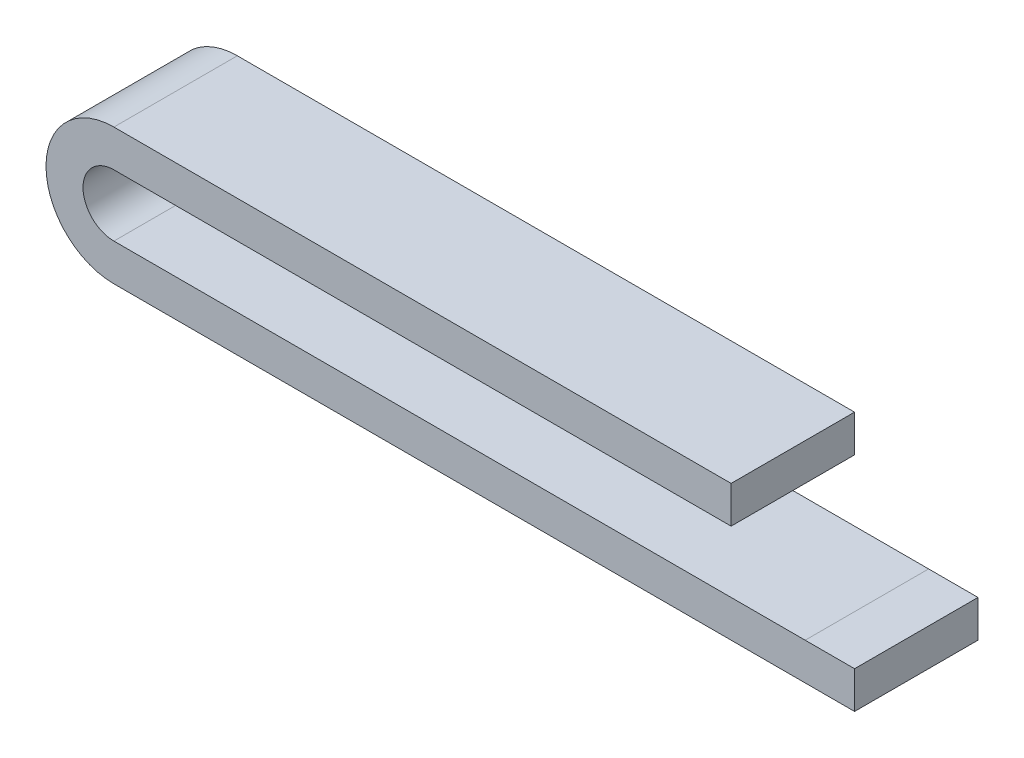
from build123d import *

# Parameters (mm, degrees)
SKETCH2_W = 5
SKETCH2_H = 1.5


with BuildPart() as part:
    # Base-Sweep: sweep along a path in Sketch1
    with BuildLine(Plane.XY) as base_sweep_path:
        Line((30, 0), (0, 0))
        ThreePointArc((0, 0), (-2, 2), (0, 4))
        Line((0, 4), (25, 4))
    # Sketch2 → Base-Sweep (sweep)
    with BuildSketch(Plane(origin=(30, 0, 0), x_dir=(0, 0, -1), z_dir=(1, 0, 0))):
        Rectangle(SKETCH2_W, SKETCH2_H)
    sweep(path=base_sweep_path.line)


solid = part.part
